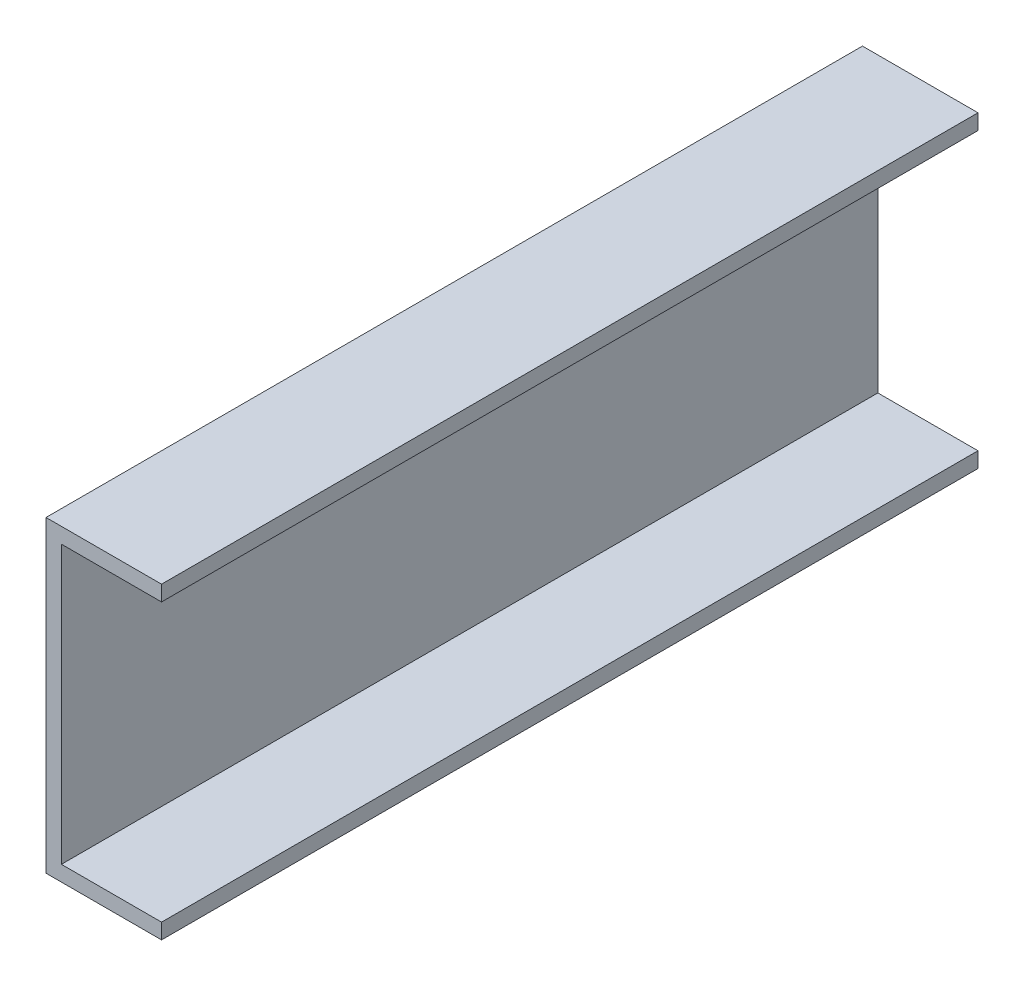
from build123d import *

# Parameters (mm, degrees)
BOSS_EXTRUDE1_DEPTH = 265


with BuildPart() as part:
    # Sketch1 → Boss-Extrude1 (new, symmetric)
    with BuildSketch(Plane.XY):
        Polygon((75, 0), (0, 0), (0, 200), (75, 200), (75, 190), (10, 190), (10, 10), (75, 10), align=None)
    extrude(amount=BOSS_EXTRUDE1_DEPTH, both=True)


solid = part.part
